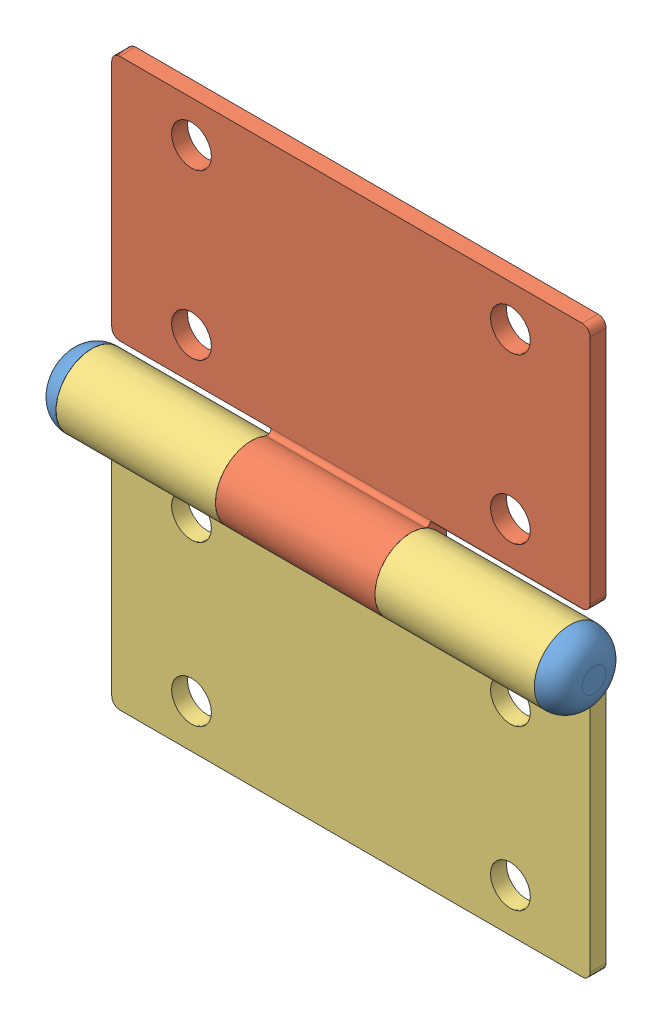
SolidWorks assembly HINGE JOINT.SLDASM, configuration Default (file format 15000). Lengths in mm.
Overall size (66 71 9).
3 component instances, 3 part files, 4 mates.
Components (placement in the parent):
- HINGE PIN-2: HINGE PIN.SLDPRT [Default] at (-106.8166 317.1995 76.3562) x (0 1 0) z (0 0 1) size (9 66 9)
- HINGE PLATE 1-2: HINGE PLATE 1.SLDPRT [Default] at (-166.8166 103.8944 71.8562) x (1 0 0) z (0 -1 0) size (60 9 40)
- HINGE PLATE 2-2: HINGE PLATE 2.SLDPRT [Default] at (-106.8166 285.7483 67.6182) x (-1 0 0) z (0 1 0) size (60 9 40)
Mates (geometry in assembly coordinates):
- Coincident14: coincident anti-aligned: line of HINGE PLATE 1-2 through (-126.8166 317.1995 76.3562) axis (-1 0 0); line of HINGE PLATE 2-2 through (-126.8166 317.1995 76.3562) axis (1 0 0)
- Coincident15: coincident anti-aligned: plane of HINGE PLATE 1-2 through (-126.8166 321.6995 131.8562) normal (1 0 0); plane of HINGE PLATE 2-2 through (-126.8166 312.6995 127.6182) normal (-1 0 0)
- Coincident16: coincident anti-aligned: plane of HINGE PIN-2 through (-166.8166 317.1995 76.3562) normal (1 0 0); plane of HINGE PLATE 2-2 through (-166.8166 312.6169 74.3562) normal (-1 0 0)
- Coincident17: coincident aligned: line of HINGE PIN-2 through (-166.8166 317.1995 76.3562) axis (1 0 0); line of HINGE PLATE 2-2 through (-166.8166 317.1995 76.3562) axis (1 0 0)
